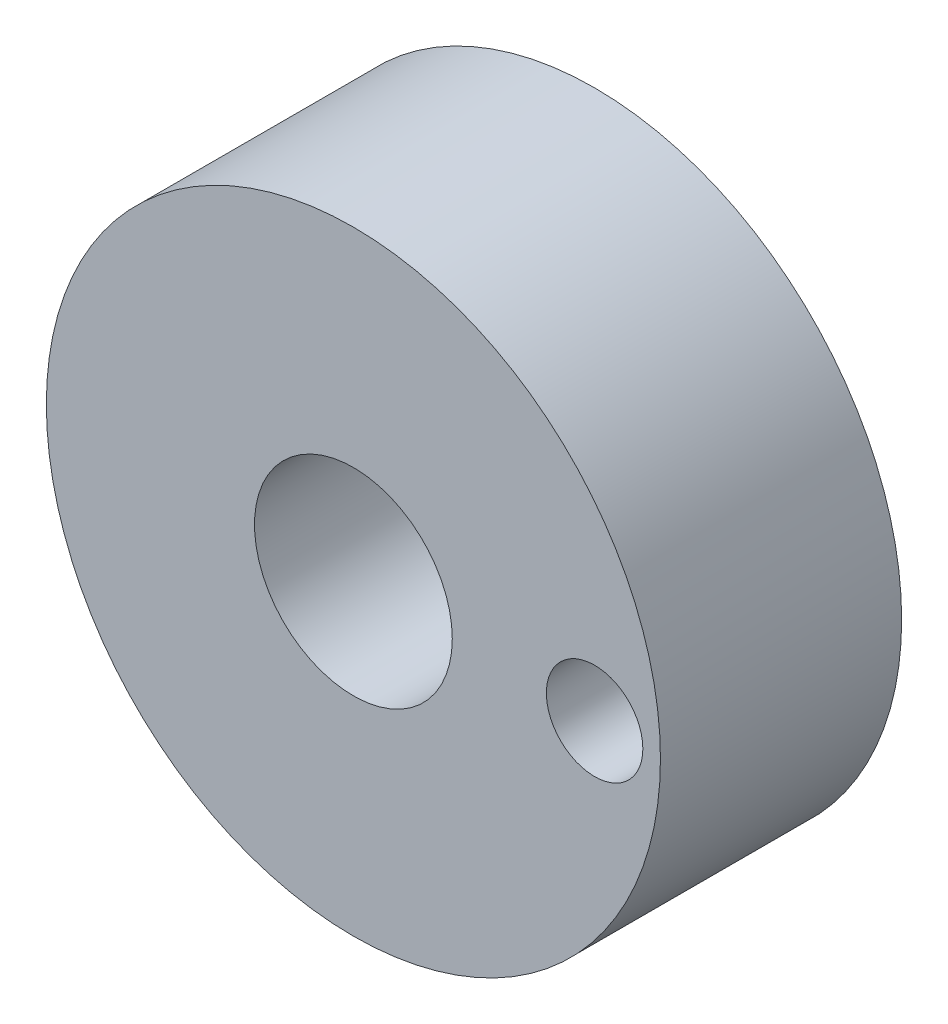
from build123d import *

# Parameters (mm, degrees)
SKETCH1_R           = 6.365
BOSS_EXTRUDE1_DEPTH = 5
SKETCH2_R           = 2.05
SKETCH2_R_2         = 1
CUT_EXTRUDE1_DEPTH  = 5


with BuildPart() as part:
    # Sketch1 → Boss-Extrude1 (new body)
    with BuildSketch(Plane.XY):
        Circle(SKETCH1_R)
    extrude(amount=BOSS_EXTRUDE1_DEPTH)

    # Sketch2 → Cut-Extrude1 (cut)
    with BuildSketch(Plane.XY.offset(5)):
        Circle(SKETCH2_R)
        with Locations((5, 0)):
            Circle(SKETCH2_R_2)
    extrude(amount=-CUT_EXTRUDE1_DEPTH, mode=Mode.SUBTRACT)


solid = part.part
